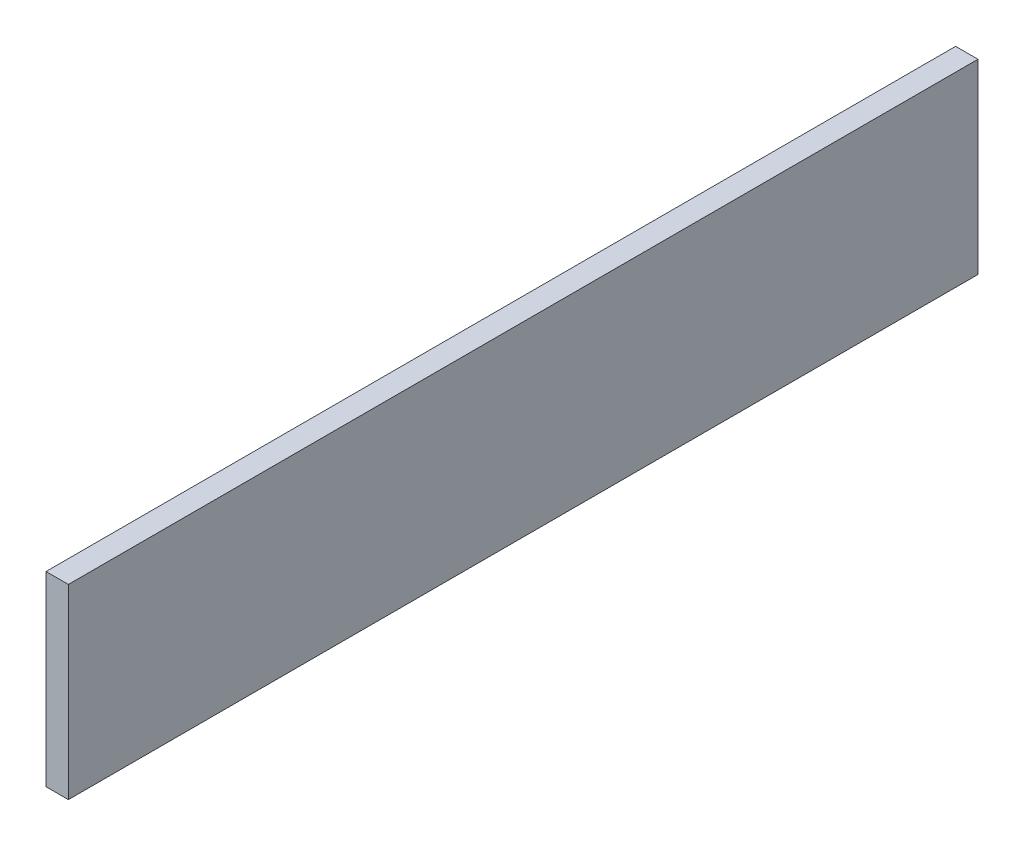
from build123d import *

# Parameters (mm, degrees)
SKETCH1_W           = 123.952
SKETCH1_H           = 25.4
BOSS_EXTRUDE1_DEPTH = 3.048


with BuildPart() as part:
    # Sketch1 → Boss-Extrude1 (new body)
    with BuildSketch(Plane(origin=(0, 0, 0), x_dir=(0, 0, -1), z_dir=(1, 0, 0))):
        with Locations((61.976, 12.7)):
            Rectangle(SKETCH1_W, SKETCH1_H)
    extrude(amount=BOSS_EXTRUDE1_DEPTH)


solid = part.part
